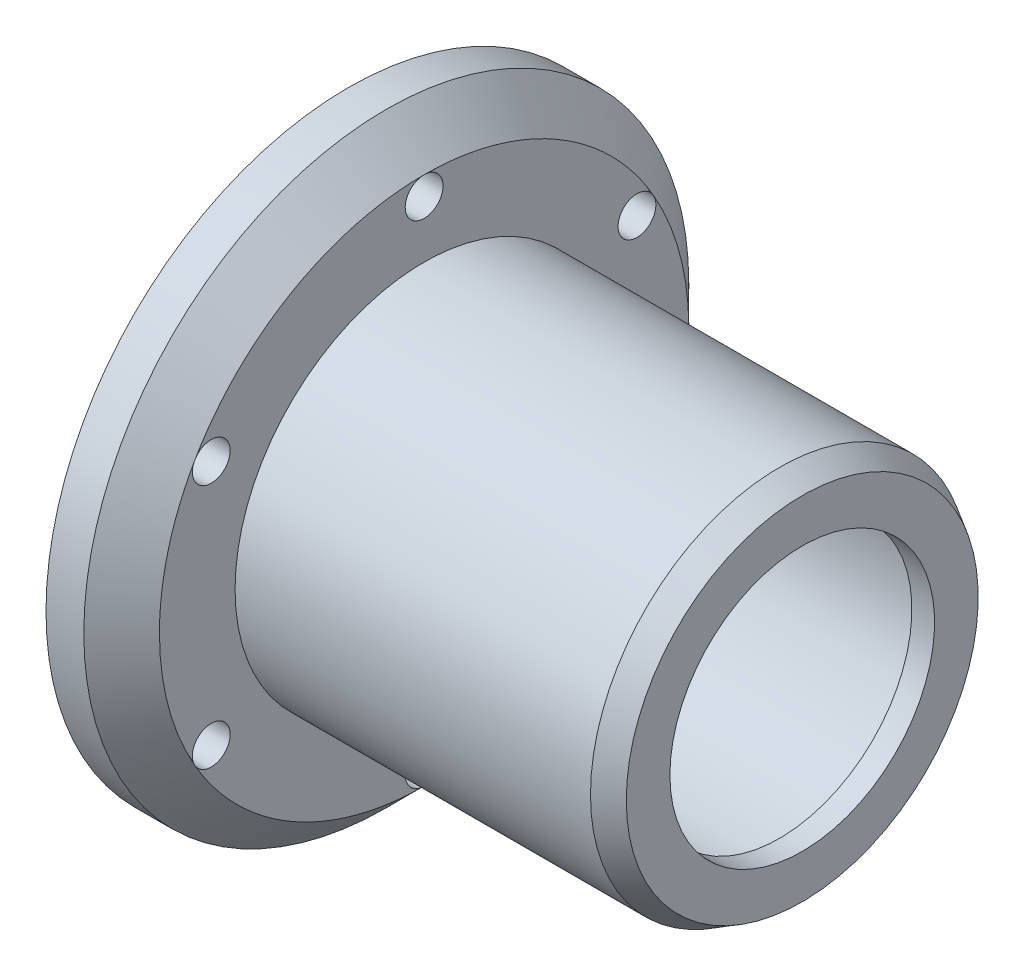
ISO-10303-21;
HEADER;
FILE_DESCRIPTION(('STEP AP214'),'2;1');
FILE_NAME('part.step','',(''),(''),'','','');
FILE_SCHEMA(('AUTOMOTIVE_DESIGN { 1 0 10303 214 1 1 1 1 }'));
ENDSEC;
DATA;
#1=APPLICATION_CONTEXT('core data for automotive mechanical design processes');
#2=APPLICATION_PROTOCOL_DEFINITION('international standard','automotive_design',2000,#1);
#3=PRODUCT_CONTEXT('',#1,'mechanical');
#4=PRODUCT('Part','Part','',(#3));
#5=PRODUCT_RELATED_PRODUCT_CATEGORY('part','',(#4));
#6=PRODUCT_DEFINITION_FORMATION('','',#4);
#7=PRODUCT_DEFINITION_CONTEXT('part definition',#1,'design');
#8=PRODUCT_DEFINITION('design','',#6,#7);
#9=PRODUCT_DEFINITION_SHAPE('','',#8);
#10=(LENGTH_UNIT() NAMED_UNIT(*) SI_UNIT(.MILLI.,.METRE.));
#11=(NAMED_UNIT(*) PLANE_ANGLE_UNIT() SI_UNIT($,.RADIAN.));
#12=(NAMED_UNIT(*) SI_UNIT($,.STERADIAN.) SOLID_ANGLE_UNIT());
#13=UNCERTAINTY_MEASURE_WITH_UNIT(LENGTH_MEASURE(1.E-05),#10,'distance_accuracy_value','');
#14=(GEOMETRIC_REPRESENTATION_CONTEXT(3) GLOBAL_UNCERTAINTY_ASSIGNED_CONTEXT((#13)) GLOBAL_UNIT_ASSIGNED_CONTEXT((#10,
#11,#12)) REPRESENTATION_CONTEXT('',''));
#15=CARTESIAN_POINT('',(0.,0.,0.));
#16=DIRECTION('',(0.,0.,1.));
#17=DIRECTION('',(1.,0.,0.));
#18=AXIS2_PLACEMENT_3D('',#15,#16,#17);
#19=CARTESIAN_POINT('',(0.487947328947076,40.,0.));
#20=DIRECTION('',(1.,0.,0.));
#21=DIRECTION('',(0.,0.,-1.));
#22=AXIS2_PLACEMENT_3D('',#19,#20,#21);
#23=PLANE('',#22);
#24=CARTESIAN_POINT('',(0.487947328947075,16.2500000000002,-28.1458256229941));
#25=DIRECTION('',(-1.,0.,0.));
#26=DIRECTION('',(0.,0.,1.));
#27=AXIS2_PLACEMENT_3D('',#24,#25,#26);
#28=CIRCLE('',#27,2.49999999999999);
#29=CARTESIAN_POINT('',(0.487947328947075,16.2500000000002,-25.6458256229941));
#30=VERTEX_POINT('',#29);
#31=EDGE_CURVE('E183',#30,#30,#28,.T.);
#32=ORIENTED_EDGE('',*,*,#31,.F.);
#33=EDGE_LOOP('',(#32));
#34=FACE_BOUND('',#33,.T.);
#35=CARTESIAN_POINT('',(0.487947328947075,0.,0.));
#36=DIRECTION('',(-1.,0.,0.));
#37=DIRECTION('',(0.,0.,1.));
#38=AXIS2_PLACEMENT_3D('',#35,#36,#37);
#39=CIRCLE('',#38,40.);
#40=CARTESIAN_POINT('',(0.487947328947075,0.,40.));
#41=VERTEX_POINT('',#40);
#42=EDGE_CURVE('E104',#41,#41,#39,.T.);
#43=ORIENTED_EDGE('',*,*,#42,.T.);
#44=EDGE_LOOP('',(#43));
#45=FACE_BOUND('',#44,.T.);
#46=CARTESIAN_POINT('',(0.487947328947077,0.,0.));
#47=DIRECTION('',(-1.,0.,0.));
#48=DIRECTION('',(0.,0.,1.));
#49=AXIS2_PLACEMENT_3D('',#46,#47,#48);
#50=CIRCLE('',#49,26.6);
#51=CARTESIAN_POINT('',(0.487947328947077,0.,26.6));
#52=VERTEX_POINT('',#51);
#53=EDGE_CURVE('E107',#52,#52,#50,.T.);
#54=ORIENTED_EDGE('',*,*,#53,.F.);
#55=EDGE_LOOP('',(#54));
#56=FACE_BOUND('',#55,.T.);
#57=CARTESIAN_POINT('',(0.487947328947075,32.5,0.));
#58=DIRECTION('',(-1.,0.,0.));
#59=DIRECTION('',(0.,0.,1.));
#60=AXIS2_PLACEMENT_3D('',#57,#58,#59);
#61=CIRCLE('',#60,2.49999999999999);
#62=CARTESIAN_POINT('',(0.487947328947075,32.5,2.49999999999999));
#63=VERTEX_POINT('',#62);
#64=EDGE_CURVE('E81',#63,#63,#61,.T.);
#65=ORIENTED_EDGE('',*,*,#64,.F.);
#66=EDGE_LOOP('',(#65));
#67=FACE_BOUND('',#66,.T.);
#68=CARTESIAN_POINT('',(0.487947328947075,16.25,28.1458256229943));
#69=DIRECTION('',(-1.,0.,0.));
#70=DIRECTION('',(0.,0.,1.));
#71=AXIS2_PLACEMENT_3D('',#68,#69,#70);
#72=CIRCLE('',#71,2.49999999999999);
#73=CARTESIAN_POINT('',(0.487947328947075,16.25,30.6458256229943));
#74=VERTEX_POINT('',#73);
#75=EDGE_CURVE('E166',#74,#74,#72,.T.);
#76=ORIENTED_EDGE('',*,*,#75,.F.);
#77=EDGE_LOOP('',(#76));
#78=FACE_BOUND('',#77,.T.);
#79=CARTESIAN_POINT('',(0.487947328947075,-16.2500000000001,28.1458256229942));
#80=DIRECTION('',(-1.,0.,0.));
#81=DIRECTION('',(0.,0.,1.));
#82=AXIS2_PLACEMENT_3D('',#79,#80,#81);
#83=CIRCLE('',#82,2.49999999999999);
#84=CARTESIAN_POINT('',(0.487947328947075,-16.2500000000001,30.6458256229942));
#85=VERTEX_POINT('',#84);
#86=EDGE_CURVE('E170',#85,#85,#83,.T.);
#87=ORIENTED_EDGE('',*,*,#86,.F.);
#88=EDGE_LOOP('',(#87));
#89=FACE_BOUND('',#88,.T.);
#90=CARTESIAN_POINT('',(0.487947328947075,-32.5,-1.69214821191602E-13));
#91=DIRECTION('',(-1.,0.,0.));
#92=DIRECTION('',(0.,0.,1.));
#93=AXIS2_PLACEMENT_3D('',#90,#91,#92);
#94=CIRCLE('',#93,2.49999999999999);
#95=CARTESIAN_POINT('',(0.487947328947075,-32.5,2.49999999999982));
#96=VERTEX_POINT('',#95);
#97=EDGE_CURVE('E174',#96,#96,#94,.T.);
#98=ORIENTED_EDGE('',*,*,#97,.F.);
#99=EDGE_LOOP('',(#98));
#100=FACE_BOUND('',#99,.T.);
#101=CARTESIAN_POINT('',(0.487947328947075,-16.2499999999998,-28.1458256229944));
#102=DIRECTION('',(-1.,0.,0.));
#103=DIRECTION('',(0.,0.,1.));
#104=AXIS2_PLACEMENT_3D('',#101,#102,#103);
#105=CIRCLE('',#104,2.49999999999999);
#106=CARTESIAN_POINT('',(0.487947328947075,-16.2499999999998,-25.6458256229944));
#107=VERTEX_POINT('',#106);
#108=EDGE_CURVE('E177',#107,#107,#105,.T.);
#109=ORIENTED_EDGE('',*,*,#108,.F.);
#110=EDGE_LOOP('',(#109));
#111=FACE_BOUND('',#110,.T.);
#112=ADVANCED_FACE('F31',(#34,#45,#56,#67,#78,#89,#100,#111),#23,.F.);
#113=CARTESIAN_POINT('',(57.4879473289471,21.,0.));
#114=DIRECTION('',(1.,0.,0.));
#115=DIRECTION('',(0.,0.,-1.));
#116=AXIS2_PLACEMENT_3D('',#113,#114,#115);
#117=PLANE('',#116);
#118=CARTESIAN_POINT('',(57.4879473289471,0.,0.));
#119=DIRECTION('',(-1.,0.,0.));
#120=DIRECTION('',(0.,0.,1.));
#121=AXIS2_PLACEMENT_3D('',#118,#119,#120);
#122=CIRCLE('',#121,17.5);
#123=CARTESIAN_POINT('',(57.4879473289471,0.,17.5));
#124=VERTEX_POINT('',#123);
#125=EDGE_CURVE('E80',#124,#124,#122,.T.);
#126=ORIENTED_EDGE('',*,*,#125,.F.);
#127=EDGE_LOOP('',(#126));
#128=FACE_BOUND('',#127,.T.);
#129=CARTESIAN_POINT('',(57.4879473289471,0.,0.));
#130=DIRECTION('',(-1.,0.,0.));
#131=DIRECTION('',(0.,0.,1.));
#132=AXIS2_PLACEMENT_3D('',#129,#130,#131);
#133=CIRCLE('',#132,21.);
#134=CARTESIAN_POINT('',(57.4879473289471,0.,21.));
#135=VERTEX_POINT('',#134);
#136=EDGE_CURVE('E11',#135,#135,#133,.T.);
#137=ORIENTED_EDGE('',*,*,#136,.T.);
#138=EDGE_LOOP('',(#137));
#139=FACE_BOUND('',#138,.T.);
#140=ADVANCED_FACE('F33',(#128,#139),#117,.F.);
#141=CARTESIAN_POINT('',(0.,0.,0.));
#142=DIRECTION('',(-1.,0.,0.));
#143=DIRECTION('',(0.,0.,1.));
#144=AXIS2_PLACEMENT_3D('',#141,#142,#143);
#145=CYLINDRICAL_SURFACE('',#144,21.);
#146=ORIENTED_EDGE('',*,*,#136,.F.);
#147=EDGE_LOOP('',(#146));
#148=FACE_BOUND('',#147,.T.);
#149=CARTESIAN_POINT('',(1.48794732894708,0.,0.));
#150=DIRECTION('',(-1.,0.,0.));
#151=DIRECTION('',(0.,0.,1.));
#152=AXIS2_PLACEMENT_3D('',#149,#150,#151);
#153=CIRCLE('',#152,21.);
#154=CARTESIAN_POINT('',(1.48794732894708,0.,21.));
#155=VERTEX_POINT('',#154);
#156=EDGE_CURVE('E39',#155,#155,#153,.T.);
#157=ORIENTED_EDGE('',*,*,#156,.T.);
#158=EDGE_LOOP('',(#157));
#159=FACE_BOUND('',#158,.T.);
#160=ADVANCED_FACE('F124',(#148,#159),#145,.F.);
#161=CARTESIAN_POINT('',(0.487947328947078,0.,0.));
#162=DIRECTION('',(-1.,0.,0.));
#163=DIRECTION('',(0.,0.,1.));
#164=AXIS2_PLACEMENT_3D('',#161,#162,#163);
#165=CONICAL_SURFACE('',#164,21.5773502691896,0.523598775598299);
#166=ORIENTED_EDGE('',*,*,#156,.F.);
#167=EDGE_LOOP('',(#166));
#168=FACE_BOUND('',#167,.T.);
#169=CARTESIAN_POINT('',(0.487947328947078,0.,0.));
#170=DIRECTION('',(-1.,0.,0.));
#171=DIRECTION('',(0.,0.,1.));
#172=AXIS2_PLACEMENT_3D('',#169,#170,#171);
#173=CIRCLE('',#172,21.5773502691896);
#174=CARTESIAN_POINT('',(0.487947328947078,0.,21.5773502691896));
#175=VERTEX_POINT('',#174);
#176=EDGE_CURVE('E119',#175,#175,#173,.T.);
#177=ORIENTED_EDGE('',*,*,#176,.T.);
#178=EDGE_LOOP('',(#177));
#179=FACE_BOUND('',#178,.T.);
#180=ADVANCED_FACE('F126',(#168,#179),#165,.F.);
#181=CARTESIAN_POINT('',(0.487947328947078,23.,0.));
#182=DIRECTION('',(1.,0.,0.));
#183=DIRECTION('',(0.,0.,-1.));
#184=AXIS2_PLACEMENT_3D('',#181,#182,#183);
#185=PLANE('',#184);
#186=ORIENTED_EDGE('',*,*,#176,.F.);
#187=EDGE_LOOP('',(#186));
#188=FACE_BOUND('',#187,.T.);
#189=CARTESIAN_POINT('',(0.487947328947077,0.,0.));
#190=DIRECTION('',(-1.,0.,0.));
#191=DIRECTION('',(0.,0.,1.));
#192=AXIS2_PLACEMENT_3D('',#189,#190,#191);
#193=CIRCLE('',#192,23.);
#194=CARTESIAN_POINT('',(0.487947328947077,0.,23.));
#195=VERTEX_POINT('',#194);
#196=EDGE_CURVE('E116',#195,#195,#193,.T.);
#197=ORIENTED_EDGE('',*,*,#196,.T.);
#198=EDGE_LOOP('',(#197));
#199=FACE_BOUND('',#198,.T.);
#200=ADVANCED_FACE('F129',(#188,#199),#185,.F.);
#201=CARTESIAN_POINT('',(0.,0.,0.));
#202=DIRECTION('',(-1.,0.,0.));
#203=DIRECTION('',(0.,0.,1.));
#204=AXIS2_PLACEMENT_3D('',#201,#202,#203);
#205=CYLINDRICAL_SURFACE('',#204,23.);
#206=ORIENTED_EDGE('',*,*,#196,.F.);
#207=EDGE_LOOP('',(#206));
#208=FACE_BOUND('',#207,.T.);
#209=CARTESIAN_POINT('',(2.08794732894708,0.,0.));
#210=DIRECTION('',(-1.,0.,0.));
#211=DIRECTION('',(0.,0.,1.));
#212=AXIS2_PLACEMENT_3D('',#209,#210,#211);
#213=CIRCLE('',#212,23.);
#214=CARTESIAN_POINT('',(2.08794732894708,0.,23.));
#215=VERTEX_POINT('',#214);
#216=EDGE_CURVE('E113',#215,#215,#213,.T.);
#217=ORIENTED_EDGE('',*,*,#216,.T.);
#218=EDGE_LOOP('',(#217));
#219=FACE_BOUND('',#218,.T.);
#220=ADVANCED_FACE('F135',(#208,#219),#205,.T.);
#221=CARTESIAN_POINT('',(2.08794732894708,26.6,0.));
#222=DIRECTION('',(1.,0.,0.));
#223=DIRECTION('',(0.,0.,-1.));
#224=AXIS2_PLACEMENT_3D('',#221,#222,#223);
#225=PLANE('',#224);
#226=ORIENTED_EDGE('',*,*,#216,.F.);
#227=EDGE_LOOP('',(#226));
#228=FACE_BOUND('',#227,.T.);
#229=CARTESIAN_POINT('',(2.08794732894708,0.,0.));
#230=DIRECTION('',(-1.,0.,0.));
#231=DIRECTION('',(0.,0.,1.));
#232=AXIS2_PLACEMENT_3D('',#229,#230,#231);
#233=CIRCLE('',#232,26.6);
#234=CARTESIAN_POINT('',(2.08794732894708,0.,26.6));
#235=VERTEX_POINT('',#234);
#236=EDGE_CURVE('E110',#235,#235,#233,.T.);
#237=ORIENTED_EDGE('',*,*,#236,.T.);
#238=EDGE_LOOP('',(#237));
#239=FACE_BOUND('',#238,.T.);
#240=ADVANCED_FACE('F141',(#228,#239),#225,.F.);
#241=CARTESIAN_POINT('',(0.,0.,0.));
#242=DIRECTION('',(-1.,0.,0.));
#243=DIRECTION('',(0.,0.,1.));
#244=AXIS2_PLACEMENT_3D('',#241,#242,#243);
#245=CYLINDRICAL_SURFACE('',#244,26.6);
#246=ORIENTED_EDGE('',*,*,#236,.F.);
#247=EDGE_LOOP('',(#246));
#248=FACE_BOUND('',#247,.T.);
#249=ORIENTED_EDGE('',*,*,#53,.T.);
#250=EDGE_LOOP('',(#249));
#251=FACE_BOUND('',#250,.T.);
#252=ADVANCED_FACE('F147',(#248,#251),#245,.F.);
#253=CARTESIAN_POINT('',(0.,0.,0.));
#254=DIRECTION('',(-1.,0.,0.));
#255=DIRECTION('',(0.,0.,1.));
#256=AXIS2_PLACEMENT_3D('',#253,#254,#255);
#257=CYLINDRICAL_SURFACE('',#256,40.);
#258=ORIENTED_EDGE('',*,*,#42,.F.);
#259=EDGE_LOOP('',(#258));
#260=FACE_BOUND('',#259,.T.);
#261=CARTESIAN_POINT('',(5.48794732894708,0.,0.));
#262=DIRECTION('',(-1.,0.,0.));
#263=DIRECTION('',(0.,0.,1.));
#264=AXIS2_PLACEMENT_3D('',#261,#262,#263);
#265=CIRCLE('',#264,40.);
#266=CARTESIAN_POINT('',(5.48794732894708,0.,40.));
#267=VERTEX_POINT('',#266);
#268=EDGE_CURVE('E101',#267,#267,#265,.T.);
#269=ORIENTED_EDGE('',*,*,#268,.T.);
#270=EDGE_LOOP('',(#269));
#271=FACE_BOUND('',#270,.T.);
#272=ADVANCED_FACE('F153',(#260,#271),#257,.T.);
#273=CARTESIAN_POINT('',(10.4879473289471,0.,0.));
#274=DIRECTION('',(-1.,0.,0.));
#275=DIRECTION('',(0.,0.,1.));
#276=AXIS2_PLACEMENT_3D('',#273,#274,#275);
#277=CONICAL_SURFACE('',#276,35.,0.785398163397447);
#278=ORIENTED_EDGE('',*,*,#268,.F.);
#279=EDGE_LOOP('',(#278));
#280=FACE_BOUND('',#279,.T.);
#281=CARTESIAN_POINT('',(10.4879473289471,0.,0.));
#282=DIRECTION('',(-1.,0.,0.));
#283=DIRECTION('',(0.,0.,1.));
#284=AXIS2_PLACEMENT_3D('',#281,#282,#283);
#285=CIRCLE('',#284,35.);
#286=CARTESIAN_POINT('',(10.4879473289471,35.,0.));
#287=VERTEX_POINT('',#286);
#288=CARTESIAN_POINT('',(10.4879473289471,17.5000000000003,-30.3108891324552));
#289=VERTEX_POINT('',#288);
#290=EDGE_CURVE('E68',#287,#289,#285,.T.);
#291=ORIENTED_EDGE('',*,*,#290,.T.);
#292=CARTESIAN_POINT('',(10.4879473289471,-17.4999999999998,-30.3108891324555));
#293=VERTEX_POINT('',#292);
#294=EDGE_CURVE('E51',#289,#293,#285,.T.);
#295=ORIENTED_EDGE('',*,*,#294,.T.);
#296=CARTESIAN_POINT('',(10.4879473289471,-35.,-1.82231345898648E-13));
#297=VERTEX_POINT('',#296);
#298=EDGE_CURVE('E320',#293,#297,#285,.T.);
#299=ORIENTED_EDGE('',*,*,#298,.T.);
#300=CARTESIAN_POINT('',(10.4879473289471,-17.5000000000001,30.3108891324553));
#301=VERTEX_POINT('',#300);
#302=EDGE_CURVE('E323',#297,#301,#285,.T.);
#303=ORIENTED_EDGE('',*,*,#302,.T.);
#304=CARTESIAN_POINT('',(10.4879473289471,17.5,30.3108891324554));
#305=VERTEX_POINT('',#304);
#306=EDGE_CURVE('E70',#301,#305,#285,.T.);
#307=ORIENTED_EDGE('',*,*,#306,.T.);
#308=EDGE_CURVE('E64',#305,#287,#285,.T.);
#309=ORIENTED_EDGE('',*,*,#308,.T.);
#310=EDGE_LOOP('',(#291,#295,#299,#303,#307,#309));
#311=FACE_BOUND('',#310,.T.);
#312=ADVANCED_FACE('F66',(#280,#311),#277,.T.);
#313=CARTESIAN_POINT('',(10.4879473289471,25.,0.));
#314=DIRECTION('',(-1.,0.,0.));
#315=DIRECTION('',(0.,0.,1.));
#316=AXIS2_PLACEMENT_3D('',#313,#314,#315);
#317=PLANE('',#316);
#318=ORIENTED_EDGE('',*,*,#294,.F.);
#319=CARTESIAN_POINT('',(10.4879473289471,16.2500000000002,-28.1458256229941));
#320=DIRECTION('',(-1.,0.,0.));
#321=DIRECTION('',(0.,0.,1.));
#322=AXIS2_PLACEMENT_3D('',#319,#320,#321);
#323=CIRCLE('',#322,2.49999999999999);
#324=EDGE_CURVE('E44',#289,#289,#323,.T.);
#325=ORIENTED_EDGE('',*,*,#324,.T.);
#326=ORIENTED_EDGE('',*,*,#290,.F.);
#327=CARTESIAN_POINT('',(10.4879473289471,32.5,0.));
#328=DIRECTION('',(-1.,0.,0.));
#329=DIRECTION('',(0.,0.,1.));
#330=AXIS2_PLACEMENT_3D('',#327,#328,#329);
#331=CIRCLE('',#330,2.49999999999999);
#332=EDGE_CURVE('E78',#287,#287,#331,.T.);
#333=ORIENTED_EDGE('',*,*,#332,.T.);
#334=ORIENTED_EDGE('',*,*,#308,.F.);
#335=CARTESIAN_POINT('',(10.4879473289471,16.25,28.1458256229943));
#336=DIRECTION('',(-1.,0.,0.));
#337=DIRECTION('',(0.,0.,1.));
#338=AXIS2_PLACEMENT_3D('',#335,#336,#337);
#339=CIRCLE('',#338,2.49999999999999);
#340=EDGE_CURVE('E87',#305,#305,#339,.T.);
#341=ORIENTED_EDGE('',*,*,#340,.T.);
#342=ORIENTED_EDGE('',*,*,#306,.F.);
#343=CARTESIAN_POINT('',(10.4879473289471,-16.2500000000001,28.1458256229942));
#344=DIRECTION('',(-1.,0.,0.));
#345=DIRECTION('',(0.,0.,1.));
#346=AXIS2_PLACEMENT_3D('',#343,#344,#345);
#347=CIRCLE('',#346,2.49999999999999);
#348=EDGE_CURVE('E192',#301,#301,#347,.T.);
#349=ORIENTED_EDGE('',*,*,#348,.T.);
#350=ORIENTED_EDGE('',*,*,#302,.F.);
#351=CARTESIAN_POINT('',(10.4879473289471,-32.5,-1.69214821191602E-13));
#352=DIRECTION('',(-1.,0.,0.));
#353=DIRECTION('',(0.,0.,1.));
#354=AXIS2_PLACEMENT_3D('',#351,#352,#353);
#355=CIRCLE('',#354,2.49999999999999);
#356=EDGE_CURVE('E188',#297,#297,#355,.T.);
#357=ORIENTED_EDGE('',*,*,#356,.T.);
#358=ORIENTED_EDGE('',*,*,#298,.F.);
#359=CARTESIAN_POINT('',(10.4879473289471,-16.2499999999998,-28.1458256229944));
#360=DIRECTION('',(-1.,0.,0.));
#361=DIRECTION('',(0.,0.,1.));
#362=AXIS2_PLACEMENT_3D('',#359,#360,#361);
#363=CIRCLE('',#362,2.49999999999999);
#364=EDGE_CURVE('E179',#293,#293,#363,.T.);
#365=ORIENTED_EDGE('',*,*,#364,.T.);
#366=EDGE_LOOP('',(#318,#325,#326,#333,#334,#341,#342,#349,#350,#357,#358,#365));
#367=FACE_BOUND('',#366,.T.);
#368=CARTESIAN_POINT('',(10.4879473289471,0.,0.));
#369=DIRECTION('',(-1.,0.,0.));
#370=DIRECTION('',(0.,0.,1.));
#371=AXIS2_PLACEMENT_3D('',#368,#369,#370);
#372=CIRCLE('',#371,25.);
#373=CARTESIAN_POINT('',(10.4879473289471,0.,25.));
#374=VERTEX_POINT('',#373);
#375=EDGE_CURVE('E75',#374,#374,#372,.T.);
#376=ORIENTED_EDGE('',*,*,#375,.T.);
#377=EDGE_LOOP('',(#376));
#378=FACE_BOUND('',#377,.T.);
#379=ADVANCED_FACE('F195',(#367,#378),#317,.F.);
#380=CARTESIAN_POINT('',(0.,0.,0.));
#381=DIRECTION('',(-1.,0.,0.));
#382=DIRECTION('',(0.,0.,1.));
#383=AXIS2_PLACEMENT_3D('',#380,#381,#382);
#384=CYLINDRICAL_SURFACE('',#383,25.);
#385=ORIENTED_EDGE('',*,*,#375,.F.);
#386=EDGE_LOOP('',(#385));
#387=FACE_BOUND('',#386,.T.);
#388=CARTESIAN_POINT('',(57.4879473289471,0.,0.));
#389=DIRECTION('',(-1.,0.,0.));
#390=DIRECTION('',(0.,0.,1.));
#391=AXIS2_PLACEMENT_3D('',#388,#389,#390);
#392=CIRCLE('',#391,25.);
#393=CARTESIAN_POINT('',(57.4879473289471,0.,25.));
#394=VERTEX_POINT('',#393);
#395=EDGE_CURVE('E96',#394,#394,#392,.T.);
#396=ORIENTED_EDGE('',*,*,#395,.T.);
#397=EDGE_LOOP('',(#396));
#398=FACE_BOUND('',#397,.T.);
#399=ADVANCED_FACE('F225',(#387,#398),#384,.T.);
#400=CARTESIAN_POINT('',(60.4879473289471,0.,0.));
#401=DIRECTION('',(-1.,0.,0.));
#402=DIRECTION('',(0.,0.,1.));
#403=AXIS2_PLACEMENT_3D('',#400,#401,#402);
#404=CONICAL_SURFACE('',#403,23.2679491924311,0.523598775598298);
#405=ORIENTED_EDGE('',*,*,#395,.F.);
#406=EDGE_LOOP('',(#405));
#407=FACE_BOUND('',#406,.T.);
#408=CARTESIAN_POINT('',(60.4879473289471,0.,0.));
#409=DIRECTION('',(-1.,0.,0.));
#410=DIRECTION('',(0.,0.,1.));
#411=AXIS2_PLACEMENT_3D('',#408,#409,#410);
#412=CIRCLE('',#411,23.2679491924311);
#413=CARTESIAN_POINT('',(60.4879473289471,0.,23.2679491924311));
#414=VERTEX_POINT('',#413);
#415=EDGE_CURVE('E93',#414,#414,#412,.T.);
#416=ORIENTED_EDGE('',*,*,#415,.T.);
#417=EDGE_LOOP('',(#416));
#418=FACE_BOUND('',#417,.T.);
#419=ADVANCED_FACE('F221',(#407,#418),#404,.T.);
#420=CARTESIAN_POINT('',(60.4879473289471,17.5,0.));
#421=DIRECTION('',(-1.,0.,0.));
#422=DIRECTION('',(0.,0.,1.));
#423=AXIS2_PLACEMENT_3D('',#420,#421,#422);
#424=PLANE('',#423);
#425=ORIENTED_EDGE('',*,*,#415,.F.);
#426=EDGE_LOOP('',(#425));
#427=FACE_BOUND('',#426,.T.);
#428=CARTESIAN_POINT('',(60.4879473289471,0.,0.));
#429=DIRECTION('',(-1.,0.,0.));
#430=DIRECTION('',(0.,0.,1.));
#431=AXIS2_PLACEMENT_3D('',#428,#429,#430);
#432=CIRCLE('',#431,17.5);
#433=CARTESIAN_POINT('',(60.4879473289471,0.,17.5));
#434=VERTEX_POINT('',#433);
#435=EDGE_CURVE('E84',#434,#434,#432,.T.);
#436=ORIENTED_EDGE('',*,*,#435,.T.);
#437=EDGE_LOOP('',(#436));
#438=FACE_BOUND('',#437,.T.);
#439=ADVANCED_FACE('F217',(#427,#438),#424,.F.);
#440=CARTESIAN_POINT('',(0.,0.,0.));
#441=DIRECTION('',(-1.,0.,0.));
#442=DIRECTION('',(0.,0.,1.));
#443=AXIS2_PLACEMENT_3D('',#440,#441,#442);
#444=CYLINDRICAL_SURFACE('',#443,17.5);
#445=ORIENTED_EDGE('',*,*,#435,.F.);
#446=EDGE_LOOP('',(#445));
#447=FACE_BOUND('',#446,.T.);
#448=ORIENTED_EDGE('',*,*,#125,.T.);
#449=EDGE_LOOP('',(#448));
#450=FACE_BOUND('',#449,.T.);
#451=ADVANCED_FACE('F210',(#447,#450),#444,.F.);
#452=CARTESIAN_POINT('',(0.487947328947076,32.5,0.));
#453=DIRECTION('',(-1.,0.,0.));
#454=DIRECTION('',(0.,0.,1.));
#455=AXIS2_PLACEMENT_3D('',#452,#453,#454);
#456=CYLINDRICAL_SURFACE('',#455,2.49999999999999);
#457=ORIENTED_EDGE('',*,*,#64,.T.);
#458=EDGE_LOOP('',(#457));
#459=FACE_BOUND('',#458,.T.);
#460=ORIENTED_EDGE('',*,*,#332,.F.);
#461=EDGE_LOOP('',(#460));
#462=FACE_BOUND('',#461,.T.);
#463=ADVANCED_FACE('F79',(#459,#462),#456,.F.);
#464=CARTESIAN_POINT('',(0.487947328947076,16.25,28.1458256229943));
#465=DIRECTION('',(-1.,0.,0.));
#466=DIRECTION('',(0.,0.,1.));
#467=AXIS2_PLACEMENT_3D('',#464,#465,#466);
#468=CYLINDRICAL_SURFACE('',#467,2.49999999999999);
#469=ORIENTED_EDGE('',*,*,#75,.T.);
#470=EDGE_LOOP('',(#469));
#471=FACE_BOUND('',#470,.T.);
#472=ORIENTED_EDGE('',*,*,#340,.F.);
#473=EDGE_LOOP('',(#472));
#474=FACE_BOUND('',#473,.T.);
#475=ADVANCED_FACE('F198',(#471,#474),#468,.F.);
#476=CARTESIAN_POINT('',(0.487947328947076,-16.2500000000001,28.1458256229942));
#477=DIRECTION('',(-1.,0.,0.));
#478=DIRECTION('',(0.,0.,1.));
#479=AXIS2_PLACEMENT_3D('',#476,#477,#478);
#480=CYLINDRICAL_SURFACE('',#479,2.49999999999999);
#481=ORIENTED_EDGE('',*,*,#86,.T.);
#482=EDGE_LOOP('',(#481));
#483=FACE_BOUND('',#482,.T.);
#484=ORIENTED_EDGE('',*,*,#348,.F.);
#485=EDGE_LOOP('',(#484));
#486=FACE_BOUND('',#485,.T.);
#487=ADVANCED_FACE('F200',(#483,#486),#480,.F.);
#488=CARTESIAN_POINT('',(0.487947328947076,-32.5,-1.69214821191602E-13));
#489=DIRECTION('',(-1.,0.,0.));
#490=DIRECTION('',(0.,0.,1.));
#491=AXIS2_PLACEMENT_3D('',#488,#489,#490);
#492=CYLINDRICAL_SURFACE('',#491,2.49999999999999);
#493=ORIENTED_EDGE('',*,*,#97,.T.);
#494=EDGE_LOOP('',(#493));
#495=FACE_BOUND('',#494,.T.);
#496=ORIENTED_EDGE('',*,*,#356,.F.);
#497=EDGE_LOOP('',(#496));
#498=FACE_BOUND('',#497,.T.);
#499=ADVANCED_FACE('F207',(#495,#498),#492,.F.);
#500=CARTESIAN_POINT('',(0.487947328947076,-16.2499999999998,-28.1458256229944));
#501=DIRECTION('',(-1.,0.,0.));
#502=DIRECTION('',(0.,0.,1.));
#503=AXIS2_PLACEMENT_3D('',#500,#501,#502);
#504=CYLINDRICAL_SURFACE('',#503,2.49999999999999);
#505=ORIENTED_EDGE('',*,*,#108,.T.);
#506=EDGE_LOOP('',(#505));
#507=FACE_BOUND('',#506,.T.);
#508=ORIENTED_EDGE('',*,*,#364,.F.);
#509=EDGE_LOOP('',(#508));
#510=FACE_BOUND('',#509,.T.);
#511=ADVANCED_FACE('F290',(#507,#510),#504,.F.);
#512=CARTESIAN_POINT('',(0.487947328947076,16.2500000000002,-28.1458256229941));
#513=DIRECTION('',(-1.,0.,0.));
#514=DIRECTION('',(0.,0.,1.));
#515=AXIS2_PLACEMENT_3D('',#512,#513,#514);
#516=CYLINDRICAL_SURFACE('',#515,2.49999999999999);
#517=ORIENTED_EDGE('',*,*,#31,.T.);
#518=EDGE_LOOP('',(#517));
#519=FACE_BOUND('',#518,.T.);
#520=ORIENTED_EDGE('',*,*,#324,.F.);
#521=EDGE_LOOP('',(#520));
#522=FACE_BOUND('',#521,.T.);
#523=ADVANCED_FACE('F299',(#519,#522),#516,.F.);
#524=CLOSED_SHELL('',(#112,#140,#160,#180,#200,#220,#240,#252,#272,#312,#379,#399,#419,#439,
#451,#463,#475,#487,#499,#511,#523));
#525=MANIFOLD_SOLID_BREP('B2',#524);
#526=ADVANCED_BREP_SHAPE_REPRESENTATION('',(#18,#525),#14);
#527=SHAPE_DEFINITION_REPRESENTATION(#9,#526);
ENDSEC;
END-ISO-10303-21;
